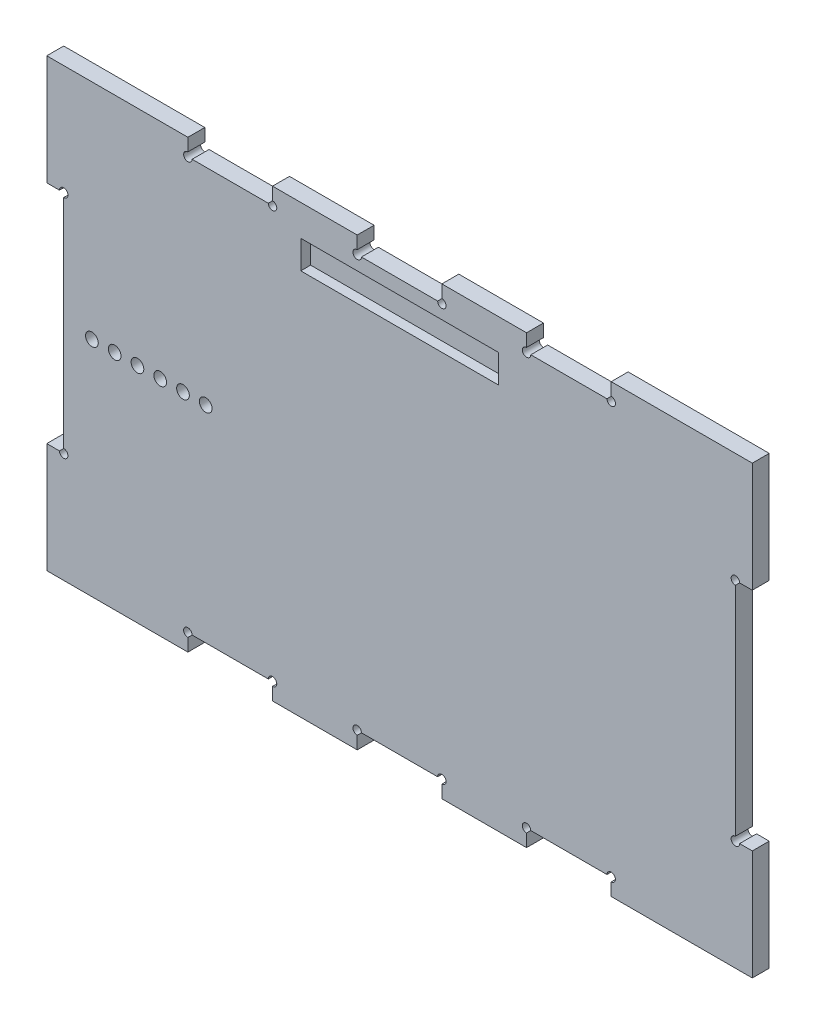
from build123d import *

# Parameters (mm, degrees)
BOSS_EXTRU_1_DEPTH      = 6
ESQUISSE3_R             = 1.5
ENL_V_MAT_EXTRU_1_DEPTH = 194.329968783
ESQUISSE5_W             = 70
ESQUISSE5_H             = 10
ENL_V_MAT_EXTRU_2_DEPTH = 3.5
ESQUISSE7_R             = 2.25
ENL_V_MAT_EXTRU_3_DEPTH = 4


with BuildPart() as part:
    # Esquisse2 → Boss.-Extru.1 (new body)
    with BuildSketch(Plane.XY):
        Polygon((-97.751923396, 36.284449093), (-97.751923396, 0), (-91.751923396, 0), (-91.751923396, -80), (-97.751923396, -80), (-97.751923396, -119), (-47.751923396, -119), (-47.751923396, -113), (-17.751923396, -113), (-17.751923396, -119), (12.248076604, -119), (12.248076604, -113), (42.248076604, -113), (42.248076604, -119), (72.248076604, -119), (72.248076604, -113), (102.248076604, -113), (102.248076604, -119), (152.248076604, -119), (152.248076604, -80), (146.248076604, -80), (146.248076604, 0), (152.248076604, 0), (152.248076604, 39), (102.248076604, 39), (102.248076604, 33), (72.248076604, 33), (72.248076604, 39), (42.248076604, 39), (42.248076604, 33), (12.248076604, 33), (12.248076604, 39), (-17.751923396, 39), (-17.751923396, 33), (-47.751923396, 33), (-47.751923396, 39), (-97.751923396, 39), align=None)
    extrude(amount=BOSS_EXTRU_1_DEPTH)

    # Esquisse3 → Enl_v. mat.-Extru.1 (cut, through all)
    with BuildSketch(Plane.XY.offset(6)):
        with Locations((-47.751923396, 33)):
            Circle(ESQUISSE3_R)
        with Locations((-17.751923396, 33)):
            Circle(ESQUISSE3_R)
        with Locations((12.248076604, 33)):
            Circle(ESQUISSE3_R)
        with Locations((42.248076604, 33)):
            Circle(ESQUISSE3_R)
        with Locations((72.248076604, 33)):
            Circle(ESQUISSE3_R)
        with Locations((102.248076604, 33)):
            Circle(ESQUISSE3_R)
        with Locations((146.248076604, 0)):
            Circle(ESQUISSE3_R)
        with Locations((146.248076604, -80)):
            Circle(ESQUISSE3_R)
        with Locations((102.248076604, -113)):
            Circle(ESQUISSE3_R)
        with Locations((72.248076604, -113)):
            Circle(ESQUISSE3_R)
        with Locations((42.248076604, -113)):
            Circle(ESQUISSE3_R)
        with Locations((12.248076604, -113)):
            Circle(ESQUISSE3_R)
        with Locations((-17.751923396, -113)):
            Circle(ESQUISSE3_R)
        with Locations((-47.751923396, -113)):
            Circle(ESQUISSE3_R)
        with Locations((-91.751923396, -80)):
            Circle(ESQUISSE3_R)
        with Locations((-91.751923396, 0)):
            Circle(ESQUISSE3_R)
    extrude(amount=-ENL_V_MAT_EXTRU_1_DEPTH, mode=Mode.SUBTRACT)

    # Esquisse5 → Enl_v. mat.-Extru.2 (cut)
    with BuildSketch(Plane.XY.offset(6)):
        with Locations((27.248076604, 23)):
            Rectangle(ESQUISSE5_W, ESQUISSE5_H)
    extrude(amount=-ENL_V_MAT_EXTRU_2_DEPTH, mode=Mode.SUBTRACT)

    # Esquisse7 → Enl_v. mat.-Extru.3 (cut)
    with BuildSketch(Plane.XY.offset(6)):
        with Locations((-81.751923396, -40)):
            Circle(ESQUISSE7_R)
        with Locations((-65.621923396, -40)):
            Circle(ESQUISSE7_R)
        with Locations((-73.686923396, -40)):
            Circle(ESQUISSE7_R)
        with Locations((-57.556923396, -40)):
            Circle(ESQUISSE7_R)
        with Locations((-49.491923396, -40)):
            Circle(ESQUISSE7_R)
        with Locations((-41.426923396, -40)):
            Circle(ESQUISSE7_R)
    extrude(amount=-ENL_V_MAT_EXTRU_3_DEPTH, mode=Mode.SUBTRACT)


solid = part.part
